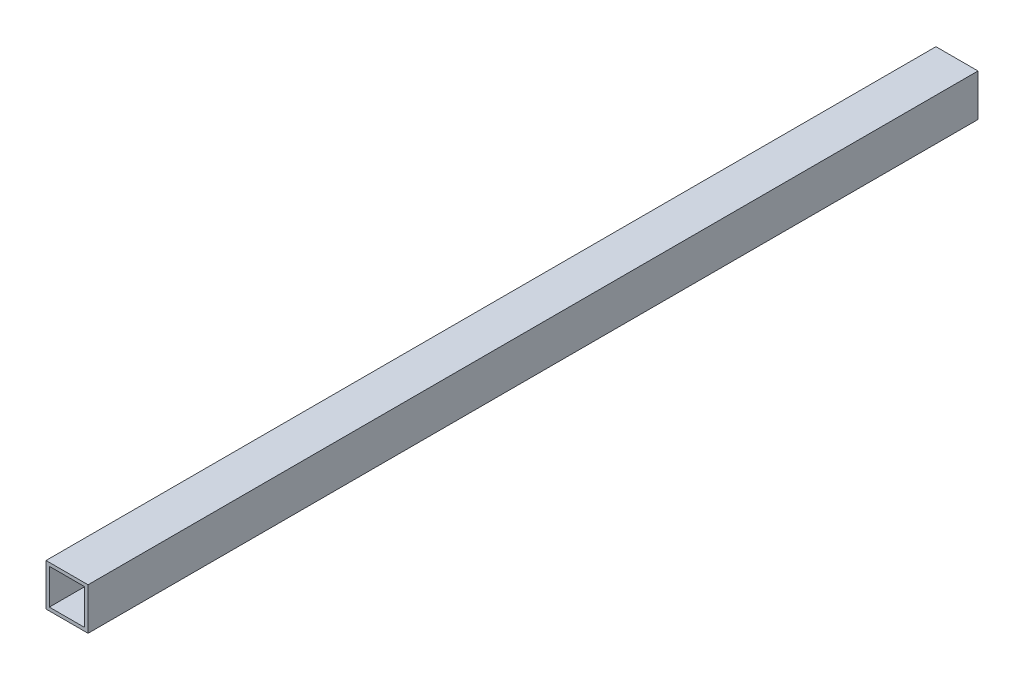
ISO-10303-21;
HEADER;
FILE_DESCRIPTION(('STEP AP214'),'2;1');
FILE_NAME('part.step','',(''),(''),'','','');
FILE_SCHEMA(('AUTOMOTIVE_DESIGN { 1 0 10303 214 1 1 1 1 }'));
ENDSEC;
DATA;
#1=APPLICATION_CONTEXT('core data for automotive mechanical design processes');
#2=APPLICATION_PROTOCOL_DEFINITION('international standard','automotive_design',2000,#1);
#3=PRODUCT_CONTEXT('',#1,'mechanical');
#4=PRODUCT('Part','Part','',(#3));
#5=PRODUCT_RELATED_PRODUCT_CATEGORY('part','',(#4));
#6=PRODUCT_DEFINITION_FORMATION('','',#4);
#7=PRODUCT_DEFINITION_CONTEXT('part definition',#1,'design');
#8=PRODUCT_DEFINITION('design','',#6,#7);
#9=PRODUCT_DEFINITION_SHAPE('','',#8);
#10=(LENGTH_UNIT() NAMED_UNIT(*) SI_UNIT(.MILLI.,.METRE.));
#11=(NAMED_UNIT(*) PLANE_ANGLE_UNIT() SI_UNIT($,.RADIAN.));
#12=(NAMED_UNIT(*) SI_UNIT($,.STERADIAN.) SOLID_ANGLE_UNIT());
#13=UNCERTAINTY_MEASURE_WITH_UNIT(LENGTH_MEASURE(1.E-05),#10,'distance_accuracy_value','');
#14=(GEOMETRIC_REPRESENTATION_CONTEXT(3) GLOBAL_UNCERTAINTY_ASSIGNED_CONTEXT((#13)) GLOBAL_UNIT_ASSIGNED_CONTEXT((#10,
#11,#12)) REPRESENTATION_CONTEXT('',''));
#15=CARTESIAN_POINT('',(0.,0.,0.));
#16=DIRECTION('',(0.,0.,1.));
#17=DIRECTION('',(1.,0.,0.));
#18=AXIS2_PLACEMENT_3D('',#15,#16,#17);
#19=CARTESIAN_POINT('',(-21.,21.,0.));
#20=DIRECTION('',(1.,0.,0.));
#21=DIRECTION('',(0.,1.,0.));
#22=AXIS2_PLACEMENT_3D('',#19,#20,#21);
#23=PLANE('',#22);
#24=DIRECTION('',(0.,-1.,0.));
#25=VECTOR('',#24,1.);
#26=CARTESIAN_POINT('',(-21.,21.,0.));
#27=LINE('',#26,#25);
#28=CARTESIAN_POINT('',(-21.,21.,0.));
#29=VERTEX_POINT('',#28);
#30=CARTESIAN_POINT('',(-21.,-21.,0.));
#31=VERTEX_POINT('',#30);
#32=EDGE_CURVE('E169',#29,#31,#27,.T.);
#33=ORIENTED_EDGE('',*,*,#32,.F.);
#34=DIRECTION('',(0.,0.,1.));
#35=VECTOR('',#34,1.);
#36=CARTESIAN_POINT('',(-21.,21.,0.));
#37=LINE('',#36,#35);
#38=CARTESIAN_POINT('',(-21.,21.,1058.));
#39=VERTEX_POINT('',#38);
#40=EDGE_CURVE('E10',#29,#39,#37,.T.);
#41=ORIENTED_EDGE('',*,*,#40,.T.);
#42=DIRECTION('',(0.,1.,0.));
#43=VECTOR('',#42,1.);
#44=CARTESIAN_POINT('',(-21.,10.5,1058.));
#45=LINE('',#44,#43);
#46=CARTESIAN_POINT('',(-21.,-21.,1058.));
#47=VERTEX_POINT('',#46);
#48=EDGE_CURVE('E120',#47,#39,#45,.T.);
#49=ORIENTED_EDGE('',*,*,#48,.F.);
#50=DIRECTION('',(0.,0.,1.));
#51=VECTOR('',#50,1.);
#52=CARTESIAN_POINT('',(-21.,-21.,0.));
#53=LINE('',#52,#51);
#54=EDGE_CURVE('E101',#31,#47,#53,.T.);
#55=ORIENTED_EDGE('',*,*,#54,.F.);
#56=EDGE_LOOP('',(#33,#41,#49,#55));
#57=FACE_BOUND('',#56,.T.);
#58=ADVANCED_FACE('F16',(#57),#23,.T.);
#59=CARTESIAN_POINT('',(21.,21.,0.));
#60=DIRECTION('',(0.,-1.,0.));
#61=DIRECTION('',(0.,0.,-1.));
#62=AXIS2_PLACEMENT_3D('',#59,#60,#61);
#63=PLANE('',#62);
#64=DIRECTION('',(-1.,0.,0.));
#65=VECTOR('',#64,1.);
#66=CARTESIAN_POINT('',(21.,21.,0.));
#67=LINE('',#66,#65);
#68=CARTESIAN_POINT('',(21.,21.,0.));
#69=VERTEX_POINT('',#68);
#70=EDGE_CURVE('E166',#69,#29,#67,.T.);
#71=ORIENTED_EDGE('',*,*,#70,.F.);
#72=DIRECTION('',(0.,0.,1.));
#73=VECTOR('',#72,1.);
#74=CARTESIAN_POINT('',(21.,21.,0.));
#75=LINE('',#74,#73);
#76=CARTESIAN_POINT('',(21.,21.,1058.));
#77=VERTEX_POINT('',#76);
#78=EDGE_CURVE('E24',#69,#77,#75,.T.);
#79=ORIENTED_EDGE('',*,*,#78,.T.);
#80=DIRECTION('',(1.,0.,0.));
#81=VECTOR('',#80,1.);
#82=CARTESIAN_POINT('',(10.5,21.,1058.));
#83=LINE('',#82,#81);
#84=EDGE_CURVE('E125',#39,#77,#83,.T.);
#85=ORIENTED_EDGE('',*,*,#84,.F.);
#86=ORIENTED_EDGE('',*,*,#40,.F.);
#87=EDGE_LOOP('',(#71,#79,#85,#86));
#88=FACE_BOUND('',#87,.T.);
#89=ADVANCED_FACE('F217',(#88),#63,.T.);
#90=CARTESIAN_POINT('',(21.,-21.,0.));
#91=DIRECTION('',(-1.,0.,0.));
#92=DIRECTION('',(0.,0.,1.));
#93=AXIS2_PLACEMENT_3D('',#90,#91,#92);
#94=PLANE('',#93);
#95=DIRECTION('',(0.,1.,0.));
#96=VECTOR('',#95,1.);
#97=CARTESIAN_POINT('',(21.,-21.,0.));
#98=LINE('',#97,#96);
#99=CARTESIAN_POINT('',(21.,-21.,0.));
#100=VERTEX_POINT('',#99);
#101=EDGE_CURVE('E162',#100,#69,#98,.T.);
#102=ORIENTED_EDGE('',*,*,#101,.F.);
#103=DIRECTION('',(0.,0.,1.));
#104=VECTOR('',#103,1.);
#105=CARTESIAN_POINT('',(21.,-21.,0.));
#106=LINE('',#105,#104);
#107=CARTESIAN_POINT('',(21.,-21.,1058.));
#108=VERTEX_POINT('',#107);
#109=EDGE_CURVE('E36',#100,#108,#106,.T.);
#110=ORIENTED_EDGE('',*,*,#109,.T.);
#111=DIRECTION('',(0.,-1.,0.));
#112=VECTOR('',#111,1.);
#113=CARTESIAN_POINT('',(21.,-10.5,1058.));
#114=LINE('',#113,#112);
#115=EDGE_CURVE('E121',#77,#108,#114,.T.);
#116=ORIENTED_EDGE('',*,*,#115,.F.);
#117=ORIENTED_EDGE('',*,*,#78,.F.);
#118=EDGE_LOOP('',(#102,#110,#116,#117));
#119=FACE_BOUND('',#118,.T.);
#120=ADVANCED_FACE('F212',(#119),#94,.T.);
#121=CARTESIAN_POINT('',(-21.,-21.,0.));
#122=DIRECTION('',(0.,1.,0.));
#123=DIRECTION('',(1.,0.,0.));
#124=AXIS2_PLACEMENT_3D('',#121,#122,#123);
#125=PLANE('',#124);
#126=DIRECTION('',(1.,0.,0.));
#127=VECTOR('',#126,1.);
#128=CARTESIAN_POINT('',(-21.,-21.,0.));
#129=LINE('',#128,#127);
#130=EDGE_CURVE('E107',#31,#100,#129,.T.);
#131=ORIENTED_EDGE('',*,*,#130,.F.);
#132=ORIENTED_EDGE('',*,*,#54,.T.);
#133=DIRECTION('',(-1.,0.,0.));
#134=VECTOR('',#133,1.);
#135=CARTESIAN_POINT('',(-10.5,-21.,1058.));
#136=LINE('',#135,#134);
#137=EDGE_CURVE('E104',#108,#47,#136,.T.);
#138=ORIENTED_EDGE('',*,*,#137,.F.);
#139=ORIENTED_EDGE('',*,*,#109,.F.);
#140=EDGE_LOOP('',(#131,#132,#138,#139));
#141=FACE_BOUND('',#140,.T.);
#142=ADVANCED_FACE('F103',(#141),#125,.T.);
#143=CARTESIAN_POINT('',(25.,25.,0.));
#144=DIRECTION('',(0.,-1.,0.));
#145=DIRECTION('',(0.,0.,-1.));
#146=AXIS2_PLACEMENT_3D('',#143,#144,#145);
#147=PLANE('',#146);
#148=DIRECTION('',(0.,0.,1.));
#149=VECTOR('',#148,1.);
#150=CARTESIAN_POINT('',(-25.,25.,0.));
#151=LINE('',#150,#149);
#152=CARTESIAN_POINT('',(-25.,25.,0.));
#153=VERTEX_POINT('',#152);
#154=CARTESIAN_POINT('',(-25.,25.,1058.));
#155=VERTEX_POINT('',#154);
#156=EDGE_CURVE('E113',#153,#155,#151,.T.);
#157=ORIENTED_EDGE('',*,*,#156,.T.);
#158=DIRECTION('',(1.,0.,0.));
#159=VECTOR('',#158,1.);
#160=CARTESIAN_POINT('',(12.5,25.,1058.));
#161=LINE('',#160,#159);
#162=CARTESIAN_POINT('',(25.,25.,1058.));
#163=VERTEX_POINT('',#162);
#164=EDGE_CURVE('E135',#155,#163,#161,.T.);
#165=ORIENTED_EDGE('',*,*,#164,.T.);
#166=DIRECTION('',(0.,0.,1.));
#167=VECTOR('',#166,1.);
#168=CARTESIAN_POINT('',(25.,25.,0.));
#169=LINE('',#168,#167);
#170=CARTESIAN_POINT('',(25.,25.,0.));
#171=VERTEX_POINT('',#170);
#172=EDGE_CURVE('E172',#171,#163,#169,.T.);
#173=ORIENTED_EDGE('',*,*,#172,.F.);
#174=DIRECTION('',(-1.,0.,0.));
#175=VECTOR('',#174,1.);
#176=CARTESIAN_POINT('',(25.,25.,0.));
#177=LINE('',#176,#175);
#178=EDGE_CURVE('E152',#171,#153,#177,.T.);
#179=ORIENTED_EDGE('',*,*,#178,.T.);
#180=EDGE_LOOP('',(#157,#165,#173,#179));
#181=FACE_BOUND('',#180,.T.);
#182=ADVANCED_FACE('F242',(#181),#147,.F.);
#183=CARTESIAN_POINT('',(-25.,25.,0.));
#184=DIRECTION('',(1.,0.,0.));
#185=DIRECTION('',(0.,1.,0.));
#186=AXIS2_PLACEMENT_3D('',#183,#184,#185);
#187=PLANE('',#186);
#188=DIRECTION('',(0.,0.,1.));
#189=VECTOR('',#188,1.);
#190=CARTESIAN_POINT('',(-25.,-25.,0.));
#191=LINE('',#190,#189);
#192=CARTESIAN_POINT('',(-25.,-25.,0.));
#193=VERTEX_POINT('',#192);
#194=CARTESIAN_POINT('',(-25.,-25.,1058.));
#195=VERTEX_POINT('',#194);
#196=EDGE_CURVE('E141',#193,#195,#191,.T.);
#197=ORIENTED_EDGE('',*,*,#196,.T.);
#198=DIRECTION('',(0.,1.,0.));
#199=VECTOR('',#198,1.);
#200=CARTESIAN_POINT('',(-25.,12.5,1058.));
#201=LINE('',#200,#199);
#202=EDGE_CURVE('E126',#195,#155,#201,.T.);
#203=ORIENTED_EDGE('',*,*,#202,.T.);
#204=ORIENTED_EDGE('',*,*,#156,.F.);
#205=DIRECTION('',(0.,-1.,0.));
#206=VECTOR('',#205,1.);
#207=CARTESIAN_POINT('',(-25.,25.,0.));
#208=LINE('',#207,#206);
#209=EDGE_CURVE('E156',#153,#193,#208,.T.);
#210=ORIENTED_EDGE('',*,*,#209,.T.);
#211=EDGE_LOOP('',(#197,#203,#204,#210));
#212=FACE_BOUND('',#211,.T.);
#213=ADVANCED_FACE('F234',(#212),#187,.F.);
#214=CARTESIAN_POINT('',(0.,0.,1058.));
#215=DIRECTION('',(0.,0.,-1.));
#216=DIRECTION('',(0.,-1.,0.));
#217=AXIS2_PLACEMENT_3D('',#214,#215,#216);
#218=PLANE('',#217);
#219=ORIENTED_EDGE('',*,*,#48,.T.);
#220=ORIENTED_EDGE('',*,*,#84,.T.);
#221=ORIENTED_EDGE('',*,*,#115,.T.);
#222=ORIENTED_EDGE('',*,*,#137,.T.);
#223=EDGE_LOOP('',(#219,#220,#221,#222));
#224=FACE_BOUND('',#223,.T.);
#225=ORIENTED_EDGE('',*,*,#164,.F.);
#226=ORIENTED_EDGE('',*,*,#202,.F.);
#227=DIRECTION('',(-1.,0.,0.));
#228=VECTOR('',#227,1.);
#229=CARTESIAN_POINT('',(-12.5,-25.,1058.));
#230=LINE('',#229,#228);
#231=CARTESIAN_POINT('',(25.,-25.,1058.));
#232=VERTEX_POINT('',#231);
#233=EDGE_CURVE('E139',#232,#195,#230,.T.);
#234=ORIENTED_EDGE('',*,*,#233,.F.);
#235=DIRECTION('',(0.,-1.,0.));
#236=VECTOR('',#235,1.);
#237=CARTESIAN_POINT('',(25.,-12.5,1058.));
#238=LINE('',#237,#236);
#239=EDGE_CURVE('E147',#163,#232,#238,.T.);
#240=ORIENTED_EDGE('',*,*,#239,.F.);
#241=EDGE_LOOP('',(#225,#226,#234,#240));
#242=FACE_BOUND('',#241,.T.);
#243=ADVANCED_FACE('F117',(#224,#242),#218,.F.);
#244=CARTESIAN_POINT('',(25.,-25.,0.));
#245=DIRECTION('',(-1.,0.,0.));
#246=DIRECTION('',(0.,0.,1.));
#247=AXIS2_PLACEMENT_3D('',#244,#245,#246);
#248=PLANE('',#247);
#249=ORIENTED_EDGE('',*,*,#172,.T.);
#250=ORIENTED_EDGE('',*,*,#239,.T.);
#251=DIRECTION('',(0.,0.,1.));
#252=VECTOR('',#251,1.);
#253=CARTESIAN_POINT('',(25.,-25.,0.));
#254=LINE('',#253,#252);
#255=CARTESIAN_POINT('',(25.,-25.,0.));
#256=VERTEX_POINT('',#255);
#257=EDGE_CURVE('E290',#256,#232,#254,.T.);
#258=ORIENTED_EDGE('',*,*,#257,.F.);
#259=DIRECTION('',(0.,1.,0.));
#260=VECTOR('',#259,1.);
#261=CARTESIAN_POINT('',(25.,-25.,0.));
#262=LINE('',#261,#260);
#263=EDGE_CURVE('E148',#256,#171,#262,.T.);
#264=ORIENTED_EDGE('',*,*,#263,.T.);
#265=EDGE_LOOP('',(#249,#250,#258,#264));
#266=FACE_BOUND('',#265,.T.);
#267=ADVANCED_FACE('F206',(#266),#248,.F.);
#268=CARTESIAN_POINT('',(0.,0.,0.));
#269=DIRECTION('',(0.,0.,1.));
#270=DIRECTION('',(1.,0.,0.));
#271=AXIS2_PLACEMENT_3D('',#268,#269,#270);
#272=PLANE('',#271);
#273=ORIENTED_EDGE('',*,*,#130,.T.);
#274=ORIENTED_EDGE('',*,*,#101,.T.);
#275=ORIENTED_EDGE('',*,*,#70,.T.);
#276=ORIENTED_EDGE('',*,*,#32,.T.);
#277=EDGE_LOOP('',(#273,#274,#275,#276));
#278=FACE_BOUND('',#277,.T.);
#279=ORIENTED_EDGE('',*,*,#209,.F.);
#280=ORIENTED_EDGE('',*,*,#178,.F.);
#281=ORIENTED_EDGE('',*,*,#263,.F.);
#282=DIRECTION('',(1.,0.,0.));
#283=VECTOR('',#282,1.);
#284=CARTESIAN_POINT('',(-25.,-25.,0.));
#285=LINE('',#284,#283);
#286=EDGE_CURVE('E144',#193,#256,#285,.T.);
#287=ORIENTED_EDGE('',*,*,#286,.F.);
#288=EDGE_LOOP('',(#279,#280,#281,#287));
#289=FACE_BOUND('',#288,.T.);
#290=ADVANCED_FACE('F196',(#278,#289),#272,.F.);
#291=CARTESIAN_POINT('',(-25.,-25.,0.));
#292=DIRECTION('',(0.,1.,0.));
#293=DIRECTION('',(1.,0.,0.));
#294=AXIS2_PLACEMENT_3D('',#291,#292,#293);
#295=PLANE('',#294);
#296=ORIENTED_EDGE('',*,*,#257,.T.);
#297=ORIENTED_EDGE('',*,*,#233,.T.);
#298=ORIENTED_EDGE('',*,*,#196,.F.);
#299=ORIENTED_EDGE('',*,*,#286,.T.);
#300=EDGE_LOOP('',(#296,#297,#298,#299));
#301=FACE_BOUND('',#300,.T.);
#302=ADVANCED_FACE('F191',(#301),#295,.F.);
#303=CLOSED_SHELL('',(#58,#89,#120,#142,#182,#213,#243,#267,#290,#302));
#304=MANIFOLD_SOLID_BREP('B1',#303);
#305=ADVANCED_BREP_SHAPE_REPRESENTATION('',(#18,#304),#14);
#306=SHAPE_DEFINITION_REPRESENTATION(#9,#305);
ENDSEC;
END-ISO-10303-21;
